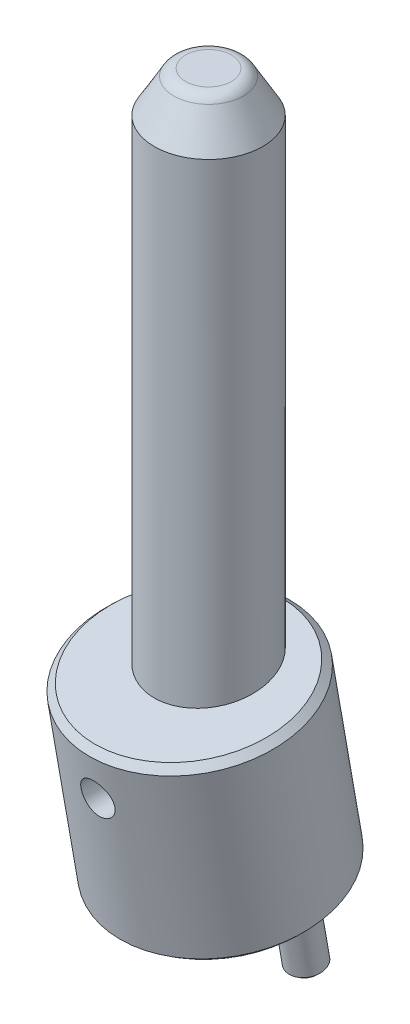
ISO-10303-21;
HEADER;
FILE_DESCRIPTION(('STEP AP214'),'2;1');
FILE_NAME('part.step','',(''),(''),'','','');
FILE_SCHEMA(('AUTOMOTIVE_DESIGN { 1 0 10303 214 1 1 1 1 }'));
ENDSEC;
DATA;
#1=APPLICATION_CONTEXT('core data for automotive mechanical design processes');
#2=APPLICATION_PROTOCOL_DEFINITION('international standard','automotive_design',2000,#1);
#3=PRODUCT_CONTEXT('',#1,'mechanical');
#4=PRODUCT('Part','Part','',(#3));
#5=PRODUCT_RELATED_PRODUCT_CATEGORY('part','',(#4));
#6=PRODUCT_DEFINITION_FORMATION('','',#4);
#7=PRODUCT_DEFINITION_CONTEXT('part definition',#1,'design');
#8=PRODUCT_DEFINITION('design','',#6,#7);
#9=PRODUCT_DEFINITION_SHAPE('','',#8);
#10=(LENGTH_UNIT() NAMED_UNIT(*) SI_UNIT(.MILLI.,.METRE.));
#11=(NAMED_UNIT(*) PLANE_ANGLE_UNIT() SI_UNIT($,.RADIAN.));
#12=(NAMED_UNIT(*) SI_UNIT($,.STERADIAN.) SOLID_ANGLE_UNIT());
#13=UNCERTAINTY_MEASURE_WITH_UNIT(LENGTH_MEASURE(1.E-05),#10,'distance_accuracy_value','');
#14=(GEOMETRIC_REPRESENTATION_CONTEXT(3) GLOBAL_UNCERTAINTY_ASSIGNED_CONTEXT((#13)) GLOBAL_UNIT_ASSIGNED_CONTEXT((#10,
#11,#12)) REPRESENTATION_CONTEXT('',''));
#15=CARTESIAN_POINT('',(0.,0.,0.));
#16=DIRECTION('',(0.,0.,1.));
#17=DIRECTION('',(1.,0.,0.));
#18=AXIS2_PLACEMENT_3D('',#15,#16,#17);
#19=CARTESIAN_POINT('',(0.,99.,0.));
#20=DIRECTION('',(0.,1.,0.));
#21=DIRECTION('',(-1.,0.,0.));
#22=AXIS2_PLACEMENT_3D('',#19,#20,#21);
#23=PLANE('',#22);
#24=CARTESIAN_POINT('',(0.,99.,-3.381197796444));
#25=CARTESIAN_POINT('',(0.0491775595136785,99.,-3.38119852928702));
#26=CARTESIAN_POINT('',(0.0983550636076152,99.,-3.38012493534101));
#27=CARTESIAN_POINT('',(0.196616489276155,99.,-3.37583435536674));
#28=CARTESIAN_POINT('',(0.245700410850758,99.,-3.37261736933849));
#29=CARTESIAN_POINT('',(0.343681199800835,99.,-3.36404526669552));
#30=CARTESIAN_POINT('',(0.392578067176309,99.,-3.35869015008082));
#31=CARTESIAN_POINT('',(0.490091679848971,99.,-3.3458522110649));
#32=CARTESIAN_POINT('',(0.53870842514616,99.,-3.33836938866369));
#33=CARTESIAN_POINT('',(0.635569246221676,99.,-3.321290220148));
#34=CARTESIAN_POINT('',(0.683813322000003,99.,-3.31169387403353));
#35=CARTESIAN_POINT('',(0.77983696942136,99.,-3.29040594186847));
#36=CARTESIAN_POINT('',(0.82761654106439,99.,-3.27871435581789));
#37=CARTESIAN_POINT('',(0.922620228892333,99.,-3.25325819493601));
#38=CARTESIAN_POINT('',(0.969844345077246,99.,-3.23949362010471));
#39=CARTESIAN_POINT('',(1.06364722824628,99.,-3.20991768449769));
#40=CARTESIAN_POINT('',(1.11022599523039,99.,-3.19410632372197));
#41=CARTESIAN_POINT('',(1.202649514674,99.,-3.16046691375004));
#42=CARTESIAN_POINT('',(1.24849426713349,99.,-3.14263886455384));
#43=CARTESIAN_POINT('',(1.33936248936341,99.,-3.10500001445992));
#44=CARTESIAN_POINT('',(1.38438595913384,99.,-3.08518921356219));
#45=CARTESIAN_POINT('',(1.47352591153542,99.,-3.04362257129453));
#46=CARTESIAN_POINT('',(1.51764239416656,99.,-3.02186672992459));
#47=CARTESIAN_POINT('',(1.60488439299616,99.,-2.97645141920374));
#48=CARTESIAN_POINT('',(1.64800990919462,99.,-2.95279194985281));
#49=CARTESIAN_POINT('',(1.73318788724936,99.,-2.90361442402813));
#50=CARTESIAN_POINT('',(1.77524034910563,99.,-2.87809636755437));
#51=CARTESIAN_POINT('',(1.85819215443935,99.,-2.82525022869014));
#52=CARTESIAN_POINT('',(1.89909149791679,98.9999999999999,-2.79792214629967));
#53=CARTESIAN_POINT('',(1.9796592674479,99.0000000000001,-2.74150802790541));
#54=CARTESIAN_POINT('',(2.01932769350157,99.0000000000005,-2.71242199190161));
#55=CARTESIAN_POINT('',(2.09735791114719,98.9999999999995,-2.65254714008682));
#56=CARTESIAN_POINT('',(2.13571970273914,98.9999999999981,-2.62175832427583));
#57=CARTESIAN_POINT('',(2.21106439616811,99.0000000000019,-2.55853724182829));
#58=CARTESIAN_POINT('',(2.24804729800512,99.000000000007,-2.52610497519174));
#59=CARTESIAN_POINT('',(2.32056094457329,98.9999999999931,-2.45965603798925));
#60=CARTESIAN_POINT('',(2.35609168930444,98.999999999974,-2.42563936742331));
#61=CARTESIAN_POINT('',(2.4270521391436,99.000000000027,-2.35468855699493));
#62=CARTESIAN_POINT('',(2.46241950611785,99.0000000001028,-2.3176920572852));
#63=CARTESIAN_POINT('',(2.53146011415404,98.9999999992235,-2.2421494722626));
#64=CARTESIAN_POINT('',(2.56513332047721,98.9999999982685,-2.20360335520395));
#65=CARTESIAN_POINT('',(2.63071590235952,98.9999999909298,-2.12503640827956));
#66=CARTESIAN_POINT('',(2.66262520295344,98.9999999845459,-2.08501551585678));
#67=CARTESIAN_POINT('',(2.72461562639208,98.9999999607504,-2.00357584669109));
#68=CARTESIAN_POINT('',(2.75469663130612,98.9999999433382,-1.962156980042));
#69=CARTESIAN_POINT('',(2.79840512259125,98.9999998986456,-1.89905244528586));
#70=CARTESIAN_POINT('',(2.81273996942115,98.9999998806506,-1.87785353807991));
#71=CARTESIAN_POINT('',(2.84090935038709,98.9999998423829,-1.83514783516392));
#72=CARTESIAN_POINT('',(2.85474423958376,98.9999998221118,-1.81364127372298));
#73=CARTESIAN_POINT('',(2.89548728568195,98.9999997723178,-1.74864245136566));
#74=CARTESIAN_POINT('',(2.92163476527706,98.9999997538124,-1.70466969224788));
#75=CARTESIAN_POINT('',(2.97183520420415,98.9999997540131,-1.61554840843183));
#76=CARTESIAN_POINT('',(2.99588817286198,98.9999997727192,-1.57039988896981));
#77=CARTESIAN_POINT('',(3.04188860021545,98.9999998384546,-1.47904330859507));
#78=CARTESIAN_POINT('',(3.06383620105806,98.999999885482,-1.43283531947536));
#79=CARTESIAN_POINT('',(3.10541271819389,98.9999999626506,-1.33939702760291));
#80=CARTESIAN_POINT('',(3.12504193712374,98.999999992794,-1.29216685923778));
#81=CARTESIAN_POINT('',(3.15291976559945,99.0000000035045,-1.22146858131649));
#82=CARTESIAN_POINT('',(3.1618349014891,99.000000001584,-1.1982567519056));
#83=CARTESIAN_POINT('',(3.19901993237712,98.9999999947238,-1.09818755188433));
#84=CARTESIAN_POINT('',(3.22479363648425,98.9999999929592,-1.02037068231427));
#85=CARTESIAN_POINT('',(3.25883872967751,98.999999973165,-0.903503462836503));
#86=CARTESIAN_POINT('',(3.26930037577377,98.999999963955,-0.865070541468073));
#87=CARTESIAN_POINT('',(3.29035807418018,98.9999999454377,-0.78187483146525));
#88=CARTESIAN_POINT('',(3.30072437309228,98.9999999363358,-0.737052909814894));
#89=CARTESIAN_POINT('',(3.31424558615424,98.9999999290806,-0.672514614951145));
#90=CARTESIAN_POINT('',(3.31816009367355,98.999999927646,-0.652953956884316));
#91=CARTESIAN_POINT('',(3.32632060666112,98.9999999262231,-0.610180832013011));
#92=CARTESIAN_POINT('',(3.33049626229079,98.9999999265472,-0.586954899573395));
#93=CARTESIAN_POINT('',(3.34228609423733,98.9999999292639,-0.517153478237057));
#94=CARTESIAN_POINT('',(3.34916375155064,98.9999999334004,-0.470451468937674));
#95=CARTESIAN_POINT('',(3.36093725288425,98.9999999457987,-0.37680095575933));
#96=CARTESIAN_POINT('',(3.36583314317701,98.9999999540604,-0.329852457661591));
#97=CARTESIAN_POINT('',(3.37363895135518,98.999999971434,-0.235792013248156));
#98=CARTESIAN_POINT('',(3.37654894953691,98.9999999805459,-0.188680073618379));
#99=CARTESIAN_POINT('',(3.38036477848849,98.9999999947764,-0.0943781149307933));
#100=CARTESIAN_POINT('',(3.381270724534,98.9999999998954,-0.0471881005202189));
#101=CARTESIAN_POINT('',(3.38112481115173,99.0000000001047,0.0472251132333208));
#102=CARTESIAN_POINT('',(3.38007141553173,98.9999999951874,0.09444830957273));
#103=CARTESIAN_POINT('',(3.37605062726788,98.9999999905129,0.188811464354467));
#104=CARTESIAN_POINT('',(3.37308329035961,98.9999999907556,0.2359514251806));
#105=CARTESIAN_POINT('',(3.36523468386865,98.9999999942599,0.330073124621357));
#106=CARTESIAN_POINT('',(3.36035337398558,98.9999999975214,0.377054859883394));
#107=CARTESIAN_POINT('',(3.34865879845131,99.0000000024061,0.47078071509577));
#108=CARTESIAN_POINT('',(3.34184539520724,99.000000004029,0.517524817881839));
#109=CARTESIAN_POINT('',(3.33026552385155,98.9999999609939,0.587415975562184));
#110=CARTESIAN_POINT('',(3.3261786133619,98.9999999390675,0.610677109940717));
#111=CARTESIAN_POINT('',(3.32001382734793,98.9999999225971,0.643328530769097));
#112=CARTESIAN_POINT('',(3.31818160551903,98.9999999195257,0.652765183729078));
#113=CARTESIAN_POINT('',(3.30790809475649,98.999999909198,0.704387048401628));
#114=CARTESIAN_POINT('',(3.29862776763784,98.999999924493,0.746407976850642));
#115=CARTESIAN_POINT('',(3.27611885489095,98.9999999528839,0.839847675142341));
#116=CARTESIAN_POINT('',(3.26247449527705,98.9999999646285,0.891165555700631));
#117=CARTESIAN_POINT('',(3.22698341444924,98.9999999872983,1.01297067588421));
#118=CARTESIAN_POINT('',(3.20401224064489,98.9999999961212,1.0831356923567));
#119=CARTESIAN_POINT('',(3.16757440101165,99.0000000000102,1.18334600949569));
#120=CARTESIAN_POINT('',(3.15590283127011,98.9999999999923,1.21405838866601));
#121=CARTESIAN_POINT('',(3.12494638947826,99.000000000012,1.2921679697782));
#122=CARTESIAN_POINT('',(3.10504413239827,99.0000000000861,1.33932320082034));
#123=CARTESIAN_POINT('',(3.06313614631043,98.9999999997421,1.43268851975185));
#124=CARTESIAN_POINT('',(3.04113038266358,98.9999999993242,1.47889859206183));
#125=CARTESIAN_POINT('',(2.9950713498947,98.9999999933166,1.57028914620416));
#126=CARTESIAN_POINT('',(2.97101799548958,98.9999999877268,1.61546958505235));
#127=CARTESIAN_POINT('',(2.92090425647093,98.9999999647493,1.7047092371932));
#128=CARTESIAN_POINT('',(2.89484373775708,98.9999999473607,1.74876837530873));
#129=CARTESIAN_POINT('',(2.85429856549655,98.9999999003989,1.81395013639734));
#130=CARTESIAN_POINT('',(2.84054017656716,98.9999998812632,1.83552759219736));
#131=CARTESIAN_POINT('',(2.81254197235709,98.9999998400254,1.87834577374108));
#132=CARTESIAN_POINT('',(2.7983025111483,98.9999998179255,1.89958673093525));
#133=CARTESIAN_POINT('',(2.75484041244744,98.9999997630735,1.96280026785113));
#134=CARTESIAN_POINT('',(2.72487327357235,98.9999997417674,2.00426478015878));
#135=CARTESIAN_POINT('',(2.6630249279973,98.999999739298,2.08573639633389));
#136=CARTESIAN_POINT('',(2.63114372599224,98.9999997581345,2.12574350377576));
#137=CARTESIAN_POINT('',(2.56557045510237,98.999999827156,2.20424440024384));
#138=CARTESIAN_POINT('',(2.53187851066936,98.9999998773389,2.24273829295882));
#139=CARTESIAN_POINT('',(2.46263073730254,98.9999999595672,2.31799882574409));
#140=CARTESIAN_POINT('',(2.42707516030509,98.9999999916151,2.35476569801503));
#141=CARTESIAN_POINT('',(2.37140677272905,99.0000000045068,2.41027252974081));
#142=CARTESIAN_POINT('',(2.35175738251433,99.0000000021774,2.42948514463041));
#143=CARTESIAN_POINT('',(2.26802085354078,98.9999999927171,2.50941121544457));
#144=CARTESIAN_POINT('',(2.20177871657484,98.9999999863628,2.56792039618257));
#145=CARTESIAN_POINT('',(2.10003782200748,98.9999999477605,2.65091291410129));
#146=CARTESIAN_POINT('',(2.06619123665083,98.9999999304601,2.67746023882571));
#147=CARTESIAN_POINT('',(1.99205588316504,98.9999998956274,2.7333276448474));
#148=CARTESIAN_POINT('',(1.95159525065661,98.9999998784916,2.76242170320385));
#149=CARTESIAN_POINT('',(1.89261855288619,98.9999998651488,2.80284359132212));
#150=CARTESIAN_POINT('',(1.87461413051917,98.9999998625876,2.81492542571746));
#151=CARTESIAN_POINT('',(1.83512217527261,98.9999998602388,2.84086885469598));
#152=CARTESIAN_POINT('',(1.81358901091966,98.9999998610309,2.85466108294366));
#153=CARTESIAN_POINT('',(1.74852510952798,98.9999998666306,2.89529180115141));
#154=CARTESIAN_POINT('',(1.70452676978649,98.999999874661,2.92138652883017));
#155=CARTESIAN_POINT('',(1.61538183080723,98.9999998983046,2.97152713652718));
#156=CARTESIAN_POINT('',(1.57023526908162,98.9999999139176,2.99557308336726));
#157=CARTESIAN_POINT('',(1.47889045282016,98.9999999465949,3.04157160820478));
#158=CARTESIAN_POINT('',(1.43269225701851,98.9999999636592,3.0635243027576));
#159=CARTESIAN_POINT('',(1.33933611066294,98.9999999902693,3.10527343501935));
#160=CARTESIAN_POINT('',(1.29217823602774,98.9999999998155,3.12507004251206));
#161=CARTESIAN_POINT('',(1.20065831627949,99.0000000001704,3.16109559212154));
#162=CARTESIAN_POINT('',(1.15635789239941,98.9999999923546,3.17748154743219));
#163=CARTESIAN_POINT('',(1.06713504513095,98.9999999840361,3.20845589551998));
#164=CARTESIAN_POINT('',(1.02221264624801,98.999999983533,3.22304435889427));
#165=CARTESIAN_POINT('',(0.931813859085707,98.9999999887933,3.25039463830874));
#166=CARTESIAN_POINT('',(0.886337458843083,98.9999999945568,3.26315641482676));
#167=CARTESIAN_POINT('',(0.794895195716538,99.0000000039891,3.28680491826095));
#168=CARTESIAN_POINT('',(0.74892929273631,99.0000000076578,3.29769149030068));
#169=CARTESIAN_POINT('',(0.686121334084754,98.9999999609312,3.31129818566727));
#170=CARTESIAN_POINT('',(0.669443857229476,98.9999999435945,3.31479031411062));
#171=CARTESIAN_POINT('',(0.639370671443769,98.9999999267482,3.32077892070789));
#172=CARTESIAN_POINT('',(0.625986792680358,98.9999999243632,3.32333471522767));
#173=CARTESIAN_POINT('',(0.564781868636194,98.9999999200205,3.33461824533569));
#174=CARTESIAN_POINT('',(0.516772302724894,98.9999999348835,3.34234416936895));
#175=CARTESIAN_POINT('',(0.428809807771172,98.9999999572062,3.35455837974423));
#176=CARTESIAN_POINT('',(0.388901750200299,98.9999999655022,3.35937566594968));
#177=CARTESIAN_POINT('',(0.315880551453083,98.9999999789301,3.36686744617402));
#178=CARTESIAN_POINT('',(0.28279046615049,98.9999999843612,3.36976874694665));
#179=CARTESIAN_POINT('',(0.198641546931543,98.9999999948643,3.37590123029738));
#180=CARTESIAN_POINT('',(0.147531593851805,98.9999999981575,3.37846406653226));
#181=CARTESIAN_POINT('',(0.0775593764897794,98.9999999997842,3.38039422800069));
#182=CARTESIAN_POINT('',(0.0587195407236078,98.9999999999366,3.38075747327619));
#183=CARTESIAN_POINT('',(0.0265859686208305,99.0000000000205,3.38112029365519));
#184=CARTESIAN_POINT('',(0.0132930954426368,99.0000000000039,3.38119547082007));
#185=CARTESIAN_POINT('',(0.,99.,3.381197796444));
#186=B_SPLINE_CURVE_WITH_KNOTS('',3,(#24,#25,#26,#27,#28,#29,#30,#31,#32,#33,#34,#35,#36,#37,
#38,#39,#40,#41,#42,#43,#44,#45,#46,#47,#48,#49,#50,#51,#52,#53,#54,#55,#56,#57,#58,#59,#60,#61,
#62,#63,#64,#65,#66,#67,#68,#69,#70,#71,#72,#73,#74,#75,#76,#77,#78,#79,#80,#81,#82,#83,#84,#85,
#86,#87,#88,#89,#90,#91,#92,#93,#94,#95,#96,#97,#98,#99,#100,#101,#102,#103,#104,#105,#106,#107,
#108,#109,#110,#111,#112,#113,#114,#115,#116,#117,#118,#119,#120,#121,#122,#123,#124,#125,#126,
#127,#128,#129,#130,#131,#132,#133,#134,#135,#136,#137,#138,#139,#140,#141,#142,#143,#144,#145,
#146,#147,#148,#149,#150,#151,#152,#153,#154,#155,#156,#157,#158,#159,#160,#161,#162,#163,#164,
#165,#166,#167,#168,#169,#170,#171,#172,#173,#174,#175,#176,#177,#178,#179,#180,#181,#182,#183,
#184,#185),.UNSPECIFIED.,.F.,.F.,(4,2,2,2,2,2,2,2,2,2,2,2,2,2,2,2,2,2,2,2,2,2,2,2,2,2,2,2,2,2,2,
2,2,2,2,2,2,2,2,2,2,2,2,2,2,2,2,2,2,2,2,2,2,2,2,2,2,2,2,2,2,2,2,2,2,2,2,2,2,2,2,2,2,2,2,2,2,2,2,
2,4),(0.,0.147520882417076,0.295041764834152,0.442562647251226,0.590083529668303,
0.737604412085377,0.885125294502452,1.03264617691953,1.18016705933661,1.32768794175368,
1.47520882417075,1.62272970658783,1.77025058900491,1.91777147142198,2.06529235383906,
2.21281323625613,2.36033411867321,2.50785500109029,2.65537588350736,2.80886971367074,
2.96236668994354,3.11587018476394,3.26938357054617,3.34614986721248,3.42286052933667,
3.57627689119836,3.72969256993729,3.88309788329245,4.03648314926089,4.11107818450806,
4.35672731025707,4.47620511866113,4.61417295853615,4.67401611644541,4.7448062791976,
4.88637772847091,5.02794587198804,5.16950829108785,5.31106256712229,5.45272787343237,
5.59438905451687,5.73605321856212,5.87772747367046,5.94857428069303,5.9774125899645,
6.106474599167,6.26572562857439,6.48702972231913,6.58558754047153,6.73908101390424,
6.89257701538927,7.04607941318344,7.19959207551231,7.27635829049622,7.3530691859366,
7.50648650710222,7.65990345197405,7.81330986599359,7.96669559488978,8.04913919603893,
8.3139440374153,8.4429705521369,8.59241517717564,8.65745956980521,8.73416806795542,
8.88757343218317,9.04097379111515,9.19436560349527,9.34774532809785,9.48940809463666,
9.6310652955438,9.77272556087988,9.91439752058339,9.9655130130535,10.006389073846,
10.152216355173,10.2727850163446,10.3724238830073,10.5258841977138,10.5824125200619,
10.6222911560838),.UNSPECIFIED.);
#187=CARTESIAN_POINT('',(0.,99.,-3.3811978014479));
#188=VERTEX_POINT('',#187);
#189=CARTESIAN_POINT('',(0.,99.,3.3811978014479));
#190=VERTEX_POINT('',#189);
#191=EDGE_CURVE('P0_E38',#188,#190,#186,.T.);
#192=ORIENTED_EDGE('',*,*,#191,.F.);
#193=CARTESIAN_POINT('',(0.,99.,0.));
#194=DIRECTION('',(0.,-1.,0.));
#195=DIRECTION('',(0.,0.,1.));
#196=AXIS2_PLACEMENT_3D('',#193,#194,#195);
#197=CIRCLE('',#196,3.381197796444);
#198=EDGE_CURVE('P0_E42',#190,#188,#197,.T.);
#199=ORIENTED_EDGE('',*,*,#198,.F.);
#200=EDGE_LOOP('',(#192,#199));
#201=FACE_BOUND('',#200,.T.);
#202=ADVANCED_FACE('P0_F17',(#201),#23,.T.);
#203=CARTESIAN_POINT('',(0.,97.,0.));
#204=DIRECTION('',(0.,1.,0.));
#205=DIRECTION('',(0.0117940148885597,0.,0.999930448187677));
#206=AXIS2_PLACEMENT_3D('',#203,#204,#205);
#207=TOROIDAL_SURFACE('',#206,3.381197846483,2.);
#208=ORIENTED_EDGE('',*,*,#191,.T.);
#209=ORIENTED_EDGE('',*,*,#198,.T.);
#210=EDGE_LOOP('',(#208,#209));
#211=FACE_BOUND('',#210,.T.);
#212=CARTESIAN_POINT('',(0.,98.0000000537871,0.));
#213=DIRECTION('',(0.,-1.,0.));
#214=DIRECTION('',(0.,0.,1.));
#215=AXIS2_PLACEMENT_3D('',#212,#213,#214);
#216=CIRCLE('',#215,5.11324862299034);
#217=CARTESIAN_POINT('',(0.,98.0000000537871,5.11324862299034));
#218=VERTEX_POINT('',#217);
#219=EDGE_CURVE('P0_E48',#218,#218,#216,.T.);
#220=ORIENTED_EDGE('',*,*,#219,.F.);
#221=EDGE_LOOP('',(#220));
#222=FACE_BOUND('',#221,.T.);
#223=ADVANCED_FACE('P0_F40',(#211,#222),#207,.T.);
#224=CARTESIAN_POINT('',(0.,0.,0.));
#225=DIRECTION('',(0.,1.,0.));
#226=DIRECTION('',(-1.,0.,0.));
#227=AXIS2_PLACEMENT_3D('',#224,#225,#226);
#228=PLANE('',#227);
#229=CARTESIAN_POINT('',(0.,6.2631058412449E-07,0.));
#230=DIRECTION('',(0.,1.,0.));
#231=DIRECTION('',(-1.,0.,0.));
#232=AXIS2_PLACEMENT_3D('',#229,#230,#231);
#233=CIRCLE('',#232,6.99999848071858);
#234=CARTESIAN_POINT('',(-6.99999848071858,6.26310584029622E-07,0.));
#235=VERTEX_POINT('',#234);
#236=EDGE_CURVE('P0_E85',#235,#235,#233,.T.);
#237=ORIENTED_EDGE('',*,*,#236,.F.);
#238=EDGE_LOOP('',(#237));
#239=FACE_BOUND('',#238,.T.);
#240=ADVANCED_FACE('P0_F76',(#239),#228,.F.);
#241=CARTESIAN_POINT('',(0.,14.,2.94337567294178));
#242=DIRECTION('',(0.,0.,1.));
#243=DIRECTION('',(0.,-1.,0.));
#244=AXIS2_PLACEMENT_3D('',#241,#242,#243);
#245=CONICAL_SURFACE('',#244,2.50000000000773,1.04719755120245);
#246=CARTESIAN_POINT('',(0.,14.0000000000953,1.49999999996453));
#247=VERTEX_POINT('',#246);
#248=VERTEX_LOOP('',#247);
#249=FACE_BOUND('',#248,.T.);
#250=CARTESIAN_POINT('',(0.,14.,2.943375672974));
#251=DIRECTION('',(0.,0.,1.));
#252=DIRECTION('',(0.,-1.,0.));
#253=AXIS2_PLACEMENT_3D('',#250,#251,#252);
#254=CIRCLE('',#253,2.5);
#255=CARTESIAN_POINT('',(0.,11.5,2.943375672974));
#256=VERTEX_POINT('',#255);
#257=EDGE_CURVE('P0_E82',#256,#256,#254,.T.);
#258=ORIENTED_EDGE('',*,*,#257,.T.);
#259=EDGE_LOOP('',(#258));
#260=FACE_BOUND('',#259,.T.);
#261=ADVANCED_FACE('P0_F116',(#249,#260),#245,.F.);
#262=CARTESIAN_POINT('',(0.,93.0000000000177,0.));
#263=DIRECTION('',(0.,-1.,0.));
#264=DIRECTION('',(1.,0.,0.));
#265=AXIS2_PLACEMENT_3D('',#262,#263,#264);
#266=CONICAL_SURFACE('',#265,7.99999999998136,0.523598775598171);
#267=CARTESIAN_POINT('',(0.,93.,0.));
#268=DIRECTION('',(0.,1.,0.));
#269=DIRECTION('',(-1.,0.,0.));
#270=AXIS2_PLACEMENT_3D('',#267,#268,#269);
#271=CIRCLE('',#270,8.);
#272=CARTESIAN_POINT('',(-8.,93.,0.));
#273=VERTEX_POINT('',#272);
#274=EDGE_CURVE('P0_E92',#273,#273,#271,.F.);
#275=ORIENTED_EDGE('',*,*,#274,.F.);
#276=EDGE_LOOP('',(#275));
#277=FACE_BOUND('',#276,.T.);
#278=ORIENTED_EDGE('',*,*,#219,.T.);
#279=EDGE_LOOP('',(#278));
#280=FACE_BOUND('',#279,.T.);
#281=ADVANCED_FACE('P0_F108',(#277,#280),#266,.T.);
#282=CARTESIAN_POINT('',(0.,1.00000173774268,0.));
#283=DIRECTION('',(0.,1.,0.));
#284=DIRECTION('',(-1.,0.,0.));
#285=AXIS2_PLACEMENT_3D('',#282,#283,#284);
#286=CONICAL_SURFACE('',#285,7.9999992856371,0.785398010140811);
#287=CARTESIAN_POINT('',(0.,1.00000102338,0.));
#288=DIRECTION('',(0.,1.,0.));
#289=DIRECTION('',(-1.,0.,0.));
#290=AXIS2_PLACEMENT_3D('',#287,#288,#289);
#291=CIRCLE('',#290,8.);
#292=CARTESIAN_POINT('',(-8.,1.00000102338,0.));
#293=VERTEX_POINT('',#292);
#294=EDGE_CURVE('P0_E28',#293,#293,#291,.T.);
#295=ORIENTED_EDGE('',*,*,#294,.F.);
#296=EDGE_LOOP('',(#295));
#297=FACE_BOUND('',#296,.T.);
#298=ORIENTED_EDGE('',*,*,#236,.T.);
#299=EDGE_LOOP('',(#298));
#300=FACE_BOUND('',#299,.T.);
#301=ADVANCED_FACE('P0_F105',(#297,#300),#286,.T.);
#302=CARTESIAN_POINT('',(0.,14.,1.075));
#303=DIRECTION('',(0.,0.,1.));
#304=DIRECTION('',(0.,-1.,0.));
#305=AXIS2_PLACEMENT_3D('',#302,#303,#304);
#306=CYLINDRICAL_SURFACE('',#305,2.5);
#307=ORIENTED_EDGE('',*,*,#257,.F.);
#308=EDGE_LOOP('',(#307));
#309=FACE_BOUND('',#308,.T.);
#310=CARTESIAN_POINT('',(0.,11.5,8.));
#311=CARTESIAN_POINT('',(-0.136696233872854,11.5000075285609,7.99999486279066));
#312=CARTESIAN_POINT('',(-0.273538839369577,11.5112631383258,7.99645812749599));
#313=CARTESIAN_POINT('',(-0.543359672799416,11.5559205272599,7.98267442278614));
#314=CARTESIAN_POINT('',(-0.676330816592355,11.589360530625,7.97241587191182));
#315=CARTESIAN_POINT('',(-0.934271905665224,11.6771461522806,7.94631394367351));
#316=CARTESIAN_POINT('',(-1.05925832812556,11.7314469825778,7.93048253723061));
#317=CARTESIAN_POINT('',(-1.2983071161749,11.8592577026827,7.89487323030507));
#318=CARTESIAN_POINT('',(-1.4123711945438,11.9327645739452,7.87509595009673));
#319=CARTESIAN_POINT('',(-1.62992724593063,12.0993097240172,7.83300483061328));
#320=CARTESIAN_POINT('',(-1.73303436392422,12.1928367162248,7.81063552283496));
#321=CARTESIAN_POINT('',(-1.92239021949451,12.3957308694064,7.76620212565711));
#322=CARTESIAN_POINT('',(-2.00863490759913,12.5051018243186,7.74413811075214));
#323=CARTESIAN_POINT('',(-2.16388692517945,12.7398894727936,7.70222283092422));
#324=CARTESIAN_POINT('',(-2.23241606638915,12.8656356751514,7.6824396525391));
#325=CARTESIAN_POINT('',(-2.34719509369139,13.1275854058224,7.64815595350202));
#326=CARTESIAN_POINT('',(-2.3934509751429,13.2637861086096,7.6336540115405));
#327=CARTESIAN_POINT('',(-2.4609691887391,13.5384561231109,7.61215214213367));
#328=CARTESIAN_POINT('',(-2.48294218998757,13.6767336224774,7.60493946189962));
#329=CARTESIAN_POINT('',(-2.50349110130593,13.9551861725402,7.59820110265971));
#330=CARTESIAN_POINT('',(-2.50207322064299,14.0953607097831,7.59867338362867));
#331=CARTESIAN_POINT('',(-2.47643652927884,14.3677485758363,7.60706377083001));
#332=CARTESIAN_POINT('',(-2.45312128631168,14.5000575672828,7.61468679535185));
#333=CARTESIAN_POINT('',(-2.38581648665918,14.7587836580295,7.63604044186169));
#334=CARTESIAN_POINT('',(-2.34182462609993,14.8852000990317,7.64977174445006));
#335=CARTESIAN_POINT('',(-2.23377596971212,15.1307074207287,7.68202134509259));
#336=CARTESIAN_POINT('',(-2.16943495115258,15.2496640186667,7.7006067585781));
#337=CARTESIAN_POINT('',(-2.02271557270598,15.4753816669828,7.74043834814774));
#338=CARTESIAN_POINT('',(-1.94033355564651,15.5821402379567,7.76168506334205));
#339=CARTESIAN_POINT('',(-1.75545127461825,15.7855312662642,7.80562654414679));
#340=CARTESIAN_POINT('',(-1.65220788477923,15.8814846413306,7.82834327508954));
#341=CARTESIAN_POINT('',(-1.43076939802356,16.0549161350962,7.87182395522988));
#342=CARTESIAN_POINT('',(-1.31256787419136,16.1323862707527,7.8925870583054));
#343=CARTESIAN_POINT('',(-1.06322528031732,16.2671146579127,7.93004255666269));
#344=CARTESIAN_POINT('',(-0.931982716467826,16.3241954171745,7.94669883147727));
#345=CARTESIAN_POINT('',(-0.661263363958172,16.4151681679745,7.97377752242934));
#346=CARTESIAN_POINT('',(-0.521804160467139,16.4491078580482,7.98421275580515));
#347=CARTESIAN_POINT('',(-0.317572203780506,16.4805676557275,7.9939447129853));
#348=CARTESIAN_POINT('',(-0.25430866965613,16.4878463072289,7.99620897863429));
#349=CARTESIAN_POINT('',(-0.127374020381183,16.4975642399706,7.99923782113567));
#350=CARTESIAN_POINT('',(-0.0637029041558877,16.5000035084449,8.000002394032));
#351=CARTESIAN_POINT('',(0.13669623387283,16.4999924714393,7.99999486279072));
#352=CARTESIAN_POINT('',(0.273538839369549,16.4887368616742,7.996458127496));
#353=CARTESIAN_POINT('',(0.543359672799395,16.4440794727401,7.98267442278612));
#354=CARTESIAN_POINT('',(0.676330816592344,16.410639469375,7.97241587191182));
#355=CARTESIAN_POINT('',(0.934271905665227,16.3228538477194,7.94631394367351));
#356=CARTESIAN_POINT('',(1.05925832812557,16.2685530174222,7.93048253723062));
#357=CARTESIAN_POINT('',(1.2983071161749,16.1407422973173,7.89487323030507));
#358=CARTESIAN_POINT('',(1.4123711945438,16.0672354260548,7.87509595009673));
#359=CARTESIAN_POINT('',(1.62992724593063,15.9006902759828,7.83300483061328));
#360=CARTESIAN_POINT('',(1.73303436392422,15.8071632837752,7.81063552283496));
#361=CARTESIAN_POINT('',(1.92239021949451,15.6042691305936,7.76620212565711));
#362=CARTESIAN_POINT('',(2.00863490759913,15.4948981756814,7.74413811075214));
#363=CARTESIAN_POINT('',(2.16388692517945,15.2601105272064,7.70222283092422));
#364=CARTESIAN_POINT('',(2.23241606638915,15.1343643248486,7.6824396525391));
#365=CARTESIAN_POINT('',(2.34719509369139,14.8724145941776,7.64815595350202));
#366=CARTESIAN_POINT('',(2.3934509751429,14.7362138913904,7.6336540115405));
#367=CARTESIAN_POINT('',(2.4609691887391,14.4615438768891,7.61215214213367));
#368=CARTESIAN_POINT('',(2.48294218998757,14.3232663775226,7.60493946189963));
#369=CARTESIAN_POINT('',(2.50349110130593,14.0448138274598,7.59820110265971));
#370=CARTESIAN_POINT('',(2.50207322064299,13.9046392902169,7.59867338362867));
#371=CARTESIAN_POINT('',(2.47643652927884,13.6322514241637,7.60706377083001));
#372=CARTESIAN_POINT('',(2.45312128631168,13.4999424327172,7.61468679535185));
#373=CARTESIAN_POINT('',(2.38581648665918,13.2412163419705,7.63604044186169));
#374=CARTESIAN_POINT('',(2.34182462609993,13.1147999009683,7.64977174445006));
#375=CARTESIAN_POINT('',(2.23377596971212,12.8692925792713,7.68202134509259));
#376=CARTESIAN_POINT('',(2.16943495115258,12.7503359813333,7.7006067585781));
#377=CARTESIAN_POINT('',(2.02271557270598,12.5246183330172,7.74043834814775));
#378=CARTESIAN_POINT('',(1.94033355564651,12.4178597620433,7.76168506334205));
#379=CARTESIAN_POINT('',(1.75545127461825,12.2144687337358,7.80562654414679));
#380=CARTESIAN_POINT('',(1.65220788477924,12.1185153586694,7.82834327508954));
#381=CARTESIAN_POINT('',(1.43076939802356,11.9450838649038,7.87182395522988));
#382=CARTESIAN_POINT('',(1.31256787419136,11.8676137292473,7.8925870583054));
#383=CARTESIAN_POINT('',(1.06322528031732,11.7328853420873,7.93004255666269));
#384=CARTESIAN_POINT('',(0.931982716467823,11.6758045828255,7.94669883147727));
#385=CARTESIAN_POINT('',(0.661263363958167,11.5848318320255,7.97377752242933));
#386=CARTESIAN_POINT('',(0.521804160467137,11.5508921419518,7.98421275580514));
#387=CARTESIAN_POINT('',(0.317572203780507,11.5194323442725,7.9939447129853));
#388=CARTESIAN_POINT('',(0.254308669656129,11.512153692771,7.9962089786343));
#389=CARTESIAN_POINT('',(0.127374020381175,11.5024357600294,7.99923782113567));
#390=CARTESIAN_POINT('',(0.0637029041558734,11.4999964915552,8.00000239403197));
#391=CARTESIAN_POINT('',(0.,11.5,8.));
#392=B_SPLINE_CURVE_WITH_KNOTS('',3,(#310,#311,#312,#313,#314,#315,#316,#317,#318,#319,#320,
#321,#322,#323,#324,#325,#326,#327,#328,#329,#330,#331,#332,#333,#334,#335,#336,#337,#338,#339,
#340,#341,#342,#343,#344,#345,#346,#347,#348,#349,#350,#351,#352,#353,#354,#355,#356,#357,#358,
#359,#360,#361,#362,#363,#364,#365,#366,#367,#368,#369,#370,#371,#372,#373,#374,#375,#376,#377,
#378,#379,#380,#381,#382,#383,#384,#385,#386,#387,#388,#389,#390,#391),.UNSPECIFIED.,.T.,.F.,(4,
2,2,2,2,2,2,2,2,2,2,2,2,2,2,2,2,2,2,2,2,2,2,2,2,2,2,2,2,2,2,2,2,2,2,2,2,2,2,2,4),(0.,
0.409843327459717,0.820394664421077,1.23006943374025,1.6396798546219,2.06074511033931,
2.48191136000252,2.91347666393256,3.34492573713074,3.76338291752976,4.18172901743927,
4.58353732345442,4.98539041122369,5.39312450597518,5.80094133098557,6.22725884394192,
6.65376015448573,7.08388858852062,7.51312773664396,7.70412159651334,7.89511596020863,
8.30495928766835,8.71551062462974,9.12518539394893,9.53479581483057,9.95586107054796,
10.3770273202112,10.8085926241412,11.2400416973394,11.6584988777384,12.0768449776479,
12.4786532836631,12.8805063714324,13.2882404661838,13.6960572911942,14.1223748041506,
14.5488761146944,14.9790045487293,15.4082436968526,15.599237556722,15.7902319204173),.UNSPECIFIED.);
#393=CARTESIAN_POINT('',(0.,11.5,8.));
#394=VERTEX_POINT('',#393);
#395=EDGE_CURVE('P0_E11',#394,#394,#392,.T.);
#396=ORIENTED_EDGE('',*,*,#395,.F.);
#397=EDGE_LOOP('',(#396));
#398=FACE_BOUND('',#397,.T.);
#399=ADVANCED_FACE('P0_F107',(#309,#398),#306,.F.);
#400=CARTESIAN_POINT('',(0.,-4.95,0.));
#401=DIRECTION('',(0.,1.,0.));
#402=DIRECTION('',(-1.,0.,0.));
#403=AXIS2_PLACEMENT_3D('',#400,#401,#402);
#404=CYLINDRICAL_SURFACE('',#403,8.);
#405=ORIENTED_EDGE('',*,*,#274,.T.);
#406=EDGE_LOOP('',(#405));
#407=FACE_BOUND('',#406,.T.);
#408=ORIENTED_EDGE('',*,*,#294,.T.);
#409=EDGE_LOOP('',(#408));
#410=FACE_BOUND('',#409,.T.);
#411=ORIENTED_EDGE('',*,*,#395,.T.);
#412=EDGE_LOOP('',(#411));
#413=FACE_BOUND('',#412,.T.);
#414=ADVANCED_FACE('P0_F102',(#407,#410,#413),#404,.T.);
#415=CLOSED_SHELL('',(#202,#223,#240,#261,#281,#301,#399,#414));
#416=MANIFOLD_SOLID_BREP('P0_B1',#415);
#417=CARTESIAN_POINT('',(0.,-11.4816197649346,-3.21008704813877));
#418=DIRECTION('',(0.,-0.984807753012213,-0.173648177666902));
#419=DIRECTION('',(0.,0.173648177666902,-0.984807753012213));
#420=AXIS2_PLACEMENT_3D('',#417,#418,#419);
#421=PLANE('',#420);
#422=CARTESIAN_POINT('',(-11.25,-11.4816197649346,-3.21008704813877));
#423=DIRECTION('',(0.,-0.984807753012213,-0.173648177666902));
#424=DIRECTION('',(0.,0.173648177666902,-0.984807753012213));
#425=AXIS2_PLACEMENT_3D('',#422,#423,#424);
#426=CIRCLE('',#425,1.9999654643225);
#427=CARTESIAN_POINT('',(-11.25,-11.1343294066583,-5.17966854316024));
#428=VERTEX_POINT('',#427);
#429=EDGE_CURVE('P1_E17',#428,#428,#426,.F.);
#430=ORIENTED_EDGE('',*,*,#429,.F.);
#431=EDGE_LOOP('',(#430));
#432=FACE_BOUND('',#431,.T.);
#433=ADVANCED_FACE('P1_F14',(#432),#421,.T.);
#434=CARTESIAN_POINT('',(0.,-11.4816197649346,-3.21008704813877));
#435=DIRECTION('',(0.,-0.984807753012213,-0.173648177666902));
#436=DIRECTION('',(0.,0.173648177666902,-0.984807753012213));
#437=AXIS2_PLACEMENT_3D('',#434,#435,#436);
#438=PLANE('',#437);
#439=CARTESIAN_POINT('',(11.25,-11.4816197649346,-3.21008704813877));
#440=DIRECTION('',(0.,-0.984807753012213,-0.173648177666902));
#441=DIRECTION('',(0.,0.173648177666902,-0.984807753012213));
#442=AXIS2_PLACEMENT_3D('',#439,#440,#441);
#443=CIRCLE('',#442,1.99996546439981);
#444=CARTESIAN_POINT('',(11.25,-11.1343294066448,-5.17966854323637));
#445=VERTEX_POINT('',#444);
#446=EDGE_CURVE('P1_E114',#445,#445,#443,.F.);
#447=ORIENTED_EDGE('',*,*,#446,.F.);
#448=EDGE_LOOP('',(#447));
#449=FACE_BOUND('',#448,.T.);
#450=ADVANCED_FACE('P1_F104',(#449),#438,.T.);
#451=CARTESIAN_POINT('',(0.,-2.78423117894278E-13,0.));
#452=DIRECTION('',(0.,-1.,0.));
#453=DIRECTION('',(0.,0.,-1.));
#454=AXIS2_PLACEMENT_3D('',#451,#452,#453);
#455=PLANE('',#454);
#456=CARTESIAN_POINT('',(0.,-1.8474805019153E-13,-1.19479079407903E-13));
#457=DIRECTION('',(0.,-1.,0.));
#458=DIRECTION('',(0.,0.,-1.));
#459=AXIS2_PLACEMENT_3D('',#456,#457,#458);
#460=CIRCLE('',#459,8.);
#461=CARTESIAN_POINT('',(0.,-1.8474805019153E-13,-8.00000000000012));
#462=VERTEX_POINT('',#461);
#463=EDGE_CURVE('P1_E116',#462,#462,#460,.F.);
#464=ORIENTED_EDGE('',*,*,#463,.T.);
#465=EDGE_LOOP('',(#464));
#466=FACE_BOUND('',#465,.T.);
#467=ADVANCED_FACE('P1_F101',(#466),#455,.F.);
#468=CARTESIAN_POINT('',(-11.25,-10.9891918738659,-3.12325872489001));
#469=DIRECTION('',(0.,0.984807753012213,0.173648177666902));
#470=DIRECTION('',(0.,-0.173648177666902,0.984807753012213));
#471=AXIS2_PLACEMENT_3D('',#468,#469,#470);
#472=CONICAL_SURFACE('',#471,2.49998121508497,0.78538952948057);
#473=CARTESIAN_POINT('',(-11.25,-10.9891733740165,-3.12325546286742));
#474=DIRECTION('',(0.,0.984807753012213,0.173648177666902));
#475=DIRECTION('',(0.,-0.173648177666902,0.984807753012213));
#476=AXIS2_PLACEMENT_3D('',#473,#474,#475);
#477=CIRCLE('',#476,2.5);
#478=CARTESIAN_POINT('',(-11.25,-11.4232938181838,-0.661236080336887));
#479=VERTEX_POINT('',#478);
#480=EDGE_CURVE('P1_E118',#479,#479,#477,.T.);
#481=ORIENTED_EDGE('',*,*,#480,.F.);
#482=EDGE_LOOP('',(#481));
#483=FACE_BOUND('',#482,.T.);
#484=ORIENTED_EDGE('',*,*,#429,.T.);
#485=EDGE_LOOP('',(#484));
#486=FACE_BOUND('',#485,.T.);
#487=ADVANCED_FACE('P1_F97',(#483,#486),#472,.T.);
#488=CARTESIAN_POINT('',(11.25,-10.9891918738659,-3.12325872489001));
#489=DIRECTION('',(0.,0.984807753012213,0.173648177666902));
#490=DIRECTION('',(0.,-0.173648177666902,0.984807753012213));
#491=AXIS2_PLACEMENT_3D('',#488,#489,#490);
#492=CONICAL_SURFACE('',#491,2.49998121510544,0.785389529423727);
#493=CARTESIAN_POINT('',(11.25,-10.9891733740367,-3.12325546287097));
#494=DIRECTION('',(0.,0.984807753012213,0.173648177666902));
#495=DIRECTION('',(0.,-0.173648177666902,0.984807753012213));
#496=AXIS2_PLACEMENT_3D('',#493,#494,#495);
#497=CIRCLE('',#496,2.5);
#498=CARTESIAN_POINT('',(11.25,-11.4232938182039,-0.66123608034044));
#499=VERTEX_POINT('',#498);
#500=EDGE_CURVE('P1_E123',#499,#499,#497,.T.);
#501=ORIENTED_EDGE('',*,*,#500,.F.);
#502=EDGE_LOOP('',(#501));
#503=FACE_BOUND('',#502,.T.);
#504=ORIENTED_EDGE('',*,*,#446,.T.);
#505=EDGE_LOOP('',(#504));
#506=FACE_BOUND('',#505,.T.);
#507=ADVANCED_FACE('P1_F92',(#503,#506),#492,.T.);
#508=CARTESIAN_POINT('',(0.,28.8048886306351,-1.196959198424E-13));
#509=DIRECTION('',(0.,-1.,0.));
#510=DIRECTION('',(0.,0.,-1.));
#511=AXIS2_PLACEMENT_3D('',#508,#509,#510);
#512=CYLINDRICAL_SURFACE('',#511,8.);
#513=CARTESIAN_POINT('',(0.,23.9999999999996,-1.196959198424E-13));
#514=DIRECTION('',(0.,0.984807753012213,0.173648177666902));
#515=DIRECTION('',(0.,-0.173648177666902,0.984807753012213));
#516=AXIS2_PLACEMENT_3D('',#513,#514,#515);
#517=ELLIPSE('',#516,8.12341289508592,8.);
#518=CARTESIAN_POINT('',(0.,22.5893841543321,7.99999999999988));
#519=VERTEX_POINT('',#518);
#520=EDGE_CURVE('P1_E79',#519,#519,#517,.F.);
#521=ORIENTED_EDGE('',*,*,#520,.F.);
#522=EDGE_LOOP('',(#521));
#523=FACE_BOUND('',#522,.T.);
#524=ORIENTED_EDGE('',*,*,#463,.F.);
#525=EDGE_LOOP('',(#524));
#526=FACE_BOUND('',#525,.T.);
#527=CARTESIAN_POINT('',(0.,16.4999999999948,7.99999999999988));
#528=CARTESIAN_POINT('',(-0.136696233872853,16.499992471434,7.99999486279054));
#529=CARTESIAN_POINT('',(-0.273538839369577,16.488736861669,7.99645812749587));
#530=CARTESIAN_POINT('',(-0.543359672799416,16.444079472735,7.98267442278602));
#531=CARTESIAN_POINT('',(-0.676330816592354,16.4106394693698,7.9724158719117));
#532=CARTESIAN_POINT('',(-0.934271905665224,16.3228538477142,7.94631394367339));
#533=CARTESIAN_POINT('',(-1.05925832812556,16.2685530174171,7.93048253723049));
#534=CARTESIAN_POINT('',(-1.2983071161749,16.1407422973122,7.89487323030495));
#535=CARTESIAN_POINT('',(-1.4123711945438,16.0672354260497,7.87509595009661));
#536=CARTESIAN_POINT('',(-1.62992724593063,15.9006902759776,7.83300483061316));
#537=CARTESIAN_POINT('',(-1.73303436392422,15.8071632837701,7.81063552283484));
#538=CARTESIAN_POINT('',(-1.92239021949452,15.6042691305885,7.76620212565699));
#539=CARTESIAN_POINT('',(-2.00863490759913,15.4948981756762,7.74413811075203));
#540=CARTESIAN_POINT('',(-2.16388692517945,15.2601105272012,7.7022228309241));
#541=CARTESIAN_POINT('',(-2.23241606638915,15.1343643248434,7.68243965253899));
#542=CARTESIAN_POINT('',(-2.34719509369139,14.8724145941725,7.6481559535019));
#543=CARTESIAN_POINT('',(-2.3934509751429,14.7362138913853,7.63365401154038));
#544=CARTESIAN_POINT('',(-2.4609691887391,14.4615438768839,7.61215214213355));
#545=CARTESIAN_POINT('',(-2.48294218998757,14.3232663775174,7.60493946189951));
#546=CARTESIAN_POINT('',(-2.50349110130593,14.0448138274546,7.59820110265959));
#547=CARTESIAN_POINT('',(-2.50207322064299,13.9046392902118,7.59867338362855));
#548=CARTESIAN_POINT('',(-2.47643652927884,13.6322514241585,7.60706377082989));
#549=CARTESIAN_POINT('',(-2.45312128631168,13.4999424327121,7.61468679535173));
#550=CARTESIAN_POINT('',(-2.38581648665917,13.2412163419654,7.63604044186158));
#551=CARTESIAN_POINT('',(-2.34182462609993,13.1147999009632,7.64977174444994));
#552=CARTESIAN_POINT('',(-2.23377596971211,12.8692925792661,7.68202134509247));
#553=CARTESIAN_POINT('',(-2.16943495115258,12.7503359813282,7.70060675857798));
#554=CARTESIAN_POINT('',(-2.02271557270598,12.5246183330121,7.74043834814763));
#555=CARTESIAN_POINT('',(-1.94033355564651,12.4178597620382,7.76168506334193));
#556=CARTESIAN_POINT('',(-1.75545127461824,12.2144687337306,7.80562654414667));
#557=CARTESIAN_POINT('',(-1.65220788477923,12.1185153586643,7.82834327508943));
#558=CARTESIAN_POINT('',(-1.43076939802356,11.9450838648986,7.87182395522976));
#559=CARTESIAN_POINT('',(-1.31256787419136,11.8676137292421,7.89258705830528));
#560=CARTESIAN_POINT('',(-1.06322528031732,11.7328853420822,7.93004255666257));
#561=CARTESIAN_POINT('',(-0.931982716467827,11.6758045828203,7.94669883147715));
#562=CARTESIAN_POINT('',(-0.661263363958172,11.5848318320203,7.97377752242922));
#563=CARTESIAN_POINT('',(-0.521804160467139,11.5508921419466,7.98421275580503));
#564=CARTESIAN_POINT('',(-0.317572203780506,11.5194323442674,7.99394471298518));
#565=CARTESIAN_POINT('',(-0.25430866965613,11.5121536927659,7.99620897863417));
#566=CARTESIAN_POINT('',(-0.127374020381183,11.5024357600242,7.99923782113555));
#567=CARTESIAN_POINT('',(-0.0637029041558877,11.4999964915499,8.00000239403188));
#568=CARTESIAN_POINT('',(0.136696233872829,11.5000075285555,7.9999948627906));
#569=CARTESIAN_POINT('',(0.273538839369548,11.5112631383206,7.99645812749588));
#570=CARTESIAN_POINT('',(0.543359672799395,11.5559205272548,7.982674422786));
#571=CARTESIAN_POINT('',(0.676330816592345,11.5893605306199,7.9724158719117));
#572=CARTESIAN_POINT('',(0.934271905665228,11.6771461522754,7.94631394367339));
#573=CARTESIAN_POINT('',(1.05925832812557,11.7314469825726,7.93048253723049));
#574=CARTESIAN_POINT('',(1.2983071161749,11.8592577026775,7.89487323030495));
#575=CARTESIAN_POINT('',(1.4123711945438,11.93276457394,7.87509595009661));
#576=CARTESIAN_POINT('',(1.62992724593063,12.099309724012,7.83300483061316));
#577=CARTESIAN_POINT('',(1.73303436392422,12.1928367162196,7.81063552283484));
#578=CARTESIAN_POINT('',(1.92239021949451,12.3957308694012,7.76620212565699));
#579=CARTESIAN_POINT('',(2.00863490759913,12.5051018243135,7.74413811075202));
#580=CARTESIAN_POINT('',(2.16388692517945,12.7398894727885,7.7022228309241));
#581=CARTESIAN_POINT('',(2.23241606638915,12.8656356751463,7.68243965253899));
#582=CARTESIAN_POINT('',(2.34719509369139,13.1275854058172,7.6481559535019));
#583=CARTESIAN_POINT('',(2.3934509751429,13.2637861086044,7.63365401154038));
#584=CARTESIAN_POINT('',(2.4609691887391,13.5384561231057,7.61215214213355));
#585=CARTESIAN_POINT('',(2.48294218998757,13.6767336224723,7.60493946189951));
#586=CARTESIAN_POINT('',(2.50349110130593,13.9551861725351,7.5982011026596));
#587=CARTESIAN_POINT('',(2.50207322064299,14.0953607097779,7.59867338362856));
#588=CARTESIAN_POINT('',(2.47643652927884,14.3677485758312,7.60706377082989));
#589=CARTESIAN_POINT('',(2.45312128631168,14.5000575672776,7.61468679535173));
#590=CARTESIAN_POINT('',(2.38581648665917,14.7587836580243,7.63604044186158));
#591=CARTESIAN_POINT('',(2.34182462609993,14.8852000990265,7.64977174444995));
#592=CARTESIAN_POINT('',(2.23377596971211,15.1307074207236,7.68202134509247));
#593=CARTESIAN_POINT('',(2.16943495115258,15.2496640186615,7.70060675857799));
#594=CARTESIAN_POINT('',(2.02271557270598,15.4753816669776,7.74043834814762));
#595=CARTESIAN_POINT('',(1.94033355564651,15.5821402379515,7.76168506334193));
#596=CARTESIAN_POINT('',(1.75545127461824,15.785531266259,7.80562654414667));
#597=CARTESIAN_POINT('',(1.65220788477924,15.8814846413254,7.82834327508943));
#598=CARTESIAN_POINT('',(1.43076939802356,16.054916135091,7.87182395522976));
#599=CARTESIAN_POINT('',(1.31256787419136,16.1323862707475,7.89258705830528));
#600=CARTESIAN_POINT('',(1.06322528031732,16.2671146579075,7.93004255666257));
#601=CARTESIAN_POINT('',(0.93198271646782,16.3241954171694,7.94669883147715));
#602=CARTESIAN_POINT('',(0.661263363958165,16.4151681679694,7.97377752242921));
#603=CARTESIAN_POINT('',(0.521804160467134,16.449107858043,7.98421275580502));
#604=CARTESIAN_POINT('',(0.317572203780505,16.4805676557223,7.99394471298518));
#605=CARTESIAN_POINT('',(0.254308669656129,16.4878463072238,7.99620897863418));
#606=CARTESIAN_POINT('',(0.127374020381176,16.4975642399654,7.99923782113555));
#607=CARTESIAN_POINT('',(0.0637029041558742,16.5000035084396,8.00000239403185));
#608=CARTESIAN_POINT('',(0.,16.4999999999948,7.99999999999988));
#609=B_SPLINE_CURVE_WITH_KNOTS('',3,(#527,#528,#529,#530,#531,#532,#533,#534,#535,#536,#537,
#538,#539,#540,#541,#542,#543,#544,#545,#546,#547,#548,#549,#550,#551,#552,#553,#554,#555,#556,
#557,#558,#559,#560,#561,#562,#563,#564,#565,#566,#567,#568,#569,#570,#571,#572,#573,#574,#575,
#576,#577,#578,#579,#580,#581,#582,#583,#584,#585,#586,#587,#588,#589,#590,#591,#592,#593,#594,
#595,#596,#597,#598,#599,#600,#601,#602,#603,#604,#605,#606,#607,#608),.UNSPECIFIED.,.T.,.F.,(4,
2,2,2,2,2,2,2,2,2,2,2,2,2,2,2,2,2,2,2,2,2,2,2,2,2,2,2,2,2,2,2,2,2,2,2,2,2,2,2,4),(0.,
0.409843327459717,0.820394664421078,1.23006943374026,1.63967985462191,2.06074511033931,
2.48191136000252,2.91347666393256,3.34492573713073,3.76338291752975,4.18172901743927,
4.58353732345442,4.9853904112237,5.39312450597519,5.80094133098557,6.22725884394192,
6.65376015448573,7.08388858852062,7.51312773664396,7.70412159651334,7.89511596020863,
8.30495928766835,8.71551062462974,9.12518539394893,9.53479581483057,9.95586107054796,
10.3770273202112,10.8085926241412,11.2400416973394,11.6584988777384,12.0768449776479,
12.4786532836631,12.8805063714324,13.2882404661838,13.6960572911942,14.1223748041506,
14.5488761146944,14.9790045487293,15.4082436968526,15.599237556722,15.7902319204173),.UNSPECIFIED.);
#610=CARTESIAN_POINT('',(0.,16.4999999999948,7.99999999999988));
#611=VERTEX_POINT('',#610);
#612=EDGE_CURVE('P1_E76',#611,#611,#609,.T.);
#613=ORIENTED_EDGE('',*,*,#612,.T.);
#614=EDGE_LOOP('',(#613));
#615=FACE_BOUND('',#614,.T.);
#616=ADVANCED_FACE('P1_F86',(#523,#526,#615),#512,.F.);
#617=CARTESIAN_POINT('',(-11.25,-4.095561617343,-1.907725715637));
#618=DIRECTION('',(0.,-0.984807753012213,-0.173648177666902));
#619=DIRECTION('',(0.,0.173648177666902,-0.984807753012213));
#620=AXIS2_PLACEMENT_3D('',#617,#618,#619);
#621=CYLINDRICAL_SURFACE('',#620,2.5);
#622=CARTESIAN_POINT('',(-11.25,-4.095561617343,-1.907725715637));
#623=DIRECTION('',(0.,-0.984807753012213,-0.173648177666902));
#624=DIRECTION('',(0.,0.173648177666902,-0.984807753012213));
#625=AXIS2_PLACEMENT_3D('',#622,#623,#624);
#626=CIRCLE('',#625,2.5);
#627=CARTESIAN_POINT('',(-11.25,-3.66144117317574,-4.36974509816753));
#628=VERTEX_POINT('',#627);
#629=EDGE_CURVE('P1_E72',#628,#628,#626,.T.);
#630=ORIENTED_EDGE('',*,*,#629,.T.);
#631=EDGE_LOOP('',(#630));
#632=FACE_BOUND('',#631,.T.);
#633=ORIENTED_EDGE('',*,*,#480,.T.);
#634=EDGE_LOOP('',(#633));
#635=FACE_BOUND('',#634,.T.);
#636=ADVANCED_FACE('P1_F91',(#632,#635),#621,.T.);
#637=CARTESIAN_POINT('',(11.25,-4.095561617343,-1.907725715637));
#638=DIRECTION('',(0.,-0.984807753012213,-0.173648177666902));
#639=DIRECTION('',(0.,0.173648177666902,-0.984807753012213));
#640=AXIS2_PLACEMENT_3D('',#637,#638,#639);
#641=CYLINDRICAL_SURFACE('',#640,2.5);
#642=CARTESIAN_POINT('',(11.25,-4.095561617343,-1.907725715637));
#643=DIRECTION('',(0.,-0.984807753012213,-0.173648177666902));
#644=DIRECTION('',(0.,0.173648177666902,-0.984807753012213));
#645=AXIS2_PLACEMENT_3D('',#642,#643,#644);
#646=CIRCLE('',#645,2.5);
#647=CARTESIAN_POINT('',(11.25,-3.66144117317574,-4.36974509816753));
#648=VERTEX_POINT('',#647);
#649=EDGE_CURVE('P1_E68',#648,#648,#646,.T.);
#650=ORIENTED_EDGE('',*,*,#649,.T.);
#651=EDGE_LOOP('',(#650));
#652=FACE_BOUND('',#651,.T.);
#653=ORIENTED_EDGE('',*,*,#500,.T.);
#654=EDGE_LOOP('',(#653));
#655=FACE_BOUND('',#654,.T.);
#656=ADVANCED_FACE('P1_F139',(#652,#655),#641,.T.);
#657=CARTESIAN_POINT('',(0.,23.479055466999,2.95442325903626));
#658=DIRECTION('',(0.,0.984807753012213,0.173648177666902));
#659=DIRECTION('',(0.,-0.173648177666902,0.984807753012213));
#660=AXIS2_PLACEMENT_3D('',#657,#658,#659);
#661=PLANE('',#660);
#662=ORIENTED_EDGE('',*,*,#520,.T.);
#663=EDGE_LOOP('',(#662));
#664=FACE_BOUND('',#663,.T.);
#665=CARTESIAN_POINT('',(0.,23.479054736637,2.95442313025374));
#666=DIRECTION('',(0.,-0.984807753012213,-0.173648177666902));
#667=DIRECTION('',(0.,0.173648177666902,-0.984807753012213));
#668=AXIS2_PLACEMENT_3D('',#665,#666,#667);
#669=CIRCLE('',#668,13.999998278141);
#670=CARTESIAN_POINT('',(0.,25.9101289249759,-10.8328837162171));
#671=VERTEX_POINT('',#670);
#672=EDGE_CURVE('P1_E38',#671,#671,#669,.T.);
#673=ORIENTED_EDGE('',*,*,#672,.F.);
#674=EDGE_LOOP('',(#673));
#675=FACE_BOUND('',#674,.T.);
#676=ADVANCED_FACE('P1_F63',(#664,#675),#661,.T.);
#677=CARTESIAN_POINT('',(0.,13.9999999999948,-2.85095709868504));
#678=DIRECTION('',(0.,0.,1.));
#679=DIRECTION('',(0.,-1.,0.));
#680=AXIS2_PLACEMENT_3D('',#677,#678,#679);
#681=CYLINDRICAL_SURFACE('',#680,2.5);
#682=ORIENTED_EDGE('',*,*,#612,.F.);
#683=EDGE_LOOP('',(#682));
#684=FACE_BOUND('',#683,.T.);
#685=CARTESIAN_POINT('',(0.,11.4999999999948,16.0735917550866));
#686=CARTESIAN_POINT('',(-0.14028096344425,11.500006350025,16.0735900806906));
#687=CARTESIAN_POINT('',(-0.280731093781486,11.5118534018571,16.0736614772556));
#688=CARTESIAN_POINT('',(-0.557836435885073,11.5589676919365,16.0741066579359));
#689=CARTESIAN_POINT('',(-0.694483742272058,11.5942803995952,16.0744810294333));
#690=CARTESIAN_POINT('',(-0.959831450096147,11.6873256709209,16.0760056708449));
#691=CARTESIAN_POINT('',(-1.08853741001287,11.7450423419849,16.0771553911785));
#692=CARTESIAN_POINT('',(-1.33436133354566,11.8812222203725,16.0809429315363));
#693=CARTESIAN_POINT('',(-1.45148422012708,11.9596765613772,16.0835801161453));
#694=CARTESIAN_POINT('',(-1.67074068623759,12.1349794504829,16.0911937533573));
#695=CARTESIAN_POINT('',(-1.77289134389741,12.2318067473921,16.0961675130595));
#696=CARTESIAN_POINT('',(-1.95944906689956,12.4410871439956,16.1093185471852));
#697=CARTESIAN_POINT('',(-2.0438557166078,12.5535406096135,16.1174958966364));
#698=CARTESIAN_POINT('',(-2.19218872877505,12.7901597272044,16.1377347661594));
#699=CARTESIAN_POINT('',(-2.25621082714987,12.9142669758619,16.1497775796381));
#700=CARTESIAN_POINT('',(-2.36262391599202,13.1709574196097,16.1782032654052));
#701=CARTESIAN_POINT('',(-2.40501571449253,13.3035402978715,16.1945859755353));
#702=CARTESIAN_POINT('',(-2.46720265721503,13.5732998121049,16.2317591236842));
#703=CARTESIAN_POINT('',(-2.48699713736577,13.710476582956,16.2525496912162));
#704=CARTESIAN_POINT('',(-2.50375379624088,13.9855413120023,16.2981803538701));
#705=CARTESIAN_POINT('',(-2.50071393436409,14.1234293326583,16.3230208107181));
#706=CARTESIAN_POINT('',(-2.47196381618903,14.3985683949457,16.3764421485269));
#707=CARTESIAN_POINT('',(-2.44586331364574,14.5357673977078,16.4050801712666));
#708=CARTESIAN_POINT('',(-2.3714359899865,14.8034963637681,16.4645822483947));
#709=CARTESIAN_POINT('',(-2.32310495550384,14.9340250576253,16.4954467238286));
#710=CARTESIAN_POINT('',(-2.2039326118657,15.1886963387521,16.5588304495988));
#711=CARTESIAN_POINT('',(-2.1324933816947,15.3125539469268,16.5913718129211));
#712=CARTESIAN_POINT('',(-1.96944114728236,15.5464901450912,16.6554724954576));
#713=CARTESIAN_POINT('',(-1.87782721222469,15.6565680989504,16.6870317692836));
#714=CARTESIAN_POINT('',(-1.67579408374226,15.8607856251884,16.7475187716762));
#715=CARTESIAN_POINT('',(-1.5652168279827,15.9547767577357,16.7764209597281));
#716=CARTESIAN_POINT('',(-1.32860824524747,16.1226950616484,16.8293110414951));
#717=CARTESIAN_POINT('',(-1.20257266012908,16.196616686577,16.8532975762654));
#718=CARTESIAN_POINT('',(-0.942801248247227,16.3197303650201,16.8938812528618));
#719=CARTESIAN_POINT('',(-0.80943048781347,16.3696247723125,16.9106863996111));
#720=CARTESIAN_POINT('',(-0.535662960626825,16.4460500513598,16.9366302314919));
#721=CARTESIAN_POINT('',(-0.395285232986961,16.4726409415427,16.9457886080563));
#722=CARTESIAN_POINT('',(-0.211603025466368,16.491391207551,16.9522540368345));
#723=CARTESIAN_POINT('',(-0.169359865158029,16.494616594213,16.9533671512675));
#724=CARTESIAN_POINT('',(-0.0847506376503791,16.4989220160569,16.9548540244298));
#725=CARTESIAN_POINT('',(-0.0423845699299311,16.5000020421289,16.9552277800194));
#726=CARTESIAN_POINT('',(0.135304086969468,16.4999934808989,16.9552230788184));
#727=CARTESIAN_POINT('',(0.270796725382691,16.4889598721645,16.9513992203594));
#728=CARTESIAN_POINT('',(0.537993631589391,16.4451923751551,16.936370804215));
#729=CARTESIAN_POINT('',(0.669689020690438,16.4124113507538,16.9251502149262));
#730=CARTESIAN_POINT('',(0.925125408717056,16.3264246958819,16.8961779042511));
#731=CARTESIAN_POINT('',(1.04888412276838,16.2732665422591,16.8784413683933));
#732=CARTESIAN_POINT('',(1.28555274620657,16.1483173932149,16.8376538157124));
#733=CARTESIAN_POINT('',(1.39846597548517,16.0765321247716,16.8146044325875));
#734=CARTESIAN_POINT('',(1.6140136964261,15.914079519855,16.7638936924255));
#735=CARTESIAN_POINT('',(1.71625023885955,15.8229206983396,16.7361170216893));
#736=CARTESIAN_POINT('',(1.90422089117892,15.6255846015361,16.6781186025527));
#737=CARTESIAN_POINT('',(1.98994992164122,15.5194027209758,16.6478961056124));
#738=CARTESIAN_POINT('',(2.14645691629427,15.2895430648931,16.5852625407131));
#739=CARTESIAN_POINT('',(2.2163735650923,15.165287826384,16.5528145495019));
#740=CARTESIAN_POINT('',(2.33419089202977,14.9065140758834,16.4888276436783));
#741=CARTESIAN_POINT('',(2.38208944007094,14.7719945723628,16.4572888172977));
#742=CARTESIAN_POINT('',(2.45483477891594,14.4945625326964,16.3963047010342));
#743=CARTESIAN_POINT('',(2.47939621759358,14.3515682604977,16.3668892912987));
#744=CARTESIAN_POINT('',(2.50340717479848,14.0627629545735,16.3118591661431));
#745=CARTESIAN_POINT('',(2.5028603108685,13.9169523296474,16.2862439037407));
#746=CARTESIAN_POINT('',(2.47659040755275,13.6301885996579,16.2401687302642));
#747=CARTESIAN_POINT('',(2.45143589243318,13.4892001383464,16.2196055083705));
#748=CARTESIAN_POINT('',(2.37720714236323,13.2130300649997,16.1832005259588));
#749=CARTESIAN_POINT('',(2.32813620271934,13.0778476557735,16.1673581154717));
#750=CARTESIAN_POINT('',(2.20887450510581,12.8208320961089,16.1405589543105));
#751=CARTESIAN_POINT('',(2.13925039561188,12.6987474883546,16.1294885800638));
#752=CARTESIAN_POINT('',(1.98039075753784,12.4677817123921,16.1111246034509));
#753=CARTESIAN_POINT('',(1.89115745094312,12.3588990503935,16.1038305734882));
#754=CARTESIAN_POINT('',(1.69631696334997,12.1582819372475,16.0922800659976));
#755=CARTESIAN_POINT('',(1.59083189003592,12.0664300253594,16.0880021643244));
#756=CARTESIAN_POINT('',(1.36594440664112,11.901514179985,16.0815383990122));
#757=CARTESIAN_POINT('',(1.24653590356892,11.8284585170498,16.0793534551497));
#758=CARTESIAN_POINT('',(0.996602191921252,11.7029475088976,16.0762570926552));
#759=CARTESIAN_POINT('',(0.866024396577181,11.6505969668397,16.0753520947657));
#760=CARTESIAN_POINT('',(0.598112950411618,11.56857653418,16.0741765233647));
#761=CARTESIAN_POINT('',(0.460792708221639,11.5388634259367,16.0739047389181));
#762=CARTESIAN_POINT('',(0.268718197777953,11.5138980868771,16.0736956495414));
#763=CARTESIAN_POINT('',(0.215114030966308,11.5086904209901,16.0736554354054));
#764=CARTESIAN_POINT('',(0.107681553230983,11.5017401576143,16.0736038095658));
#765=CARTESIAN_POINT('',(0.0538532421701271,11.4999975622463,16.0735923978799));
#766=CARTESIAN_POINT('',(0.,11.4999999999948,16.0735917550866));
#767=B_SPLINE_CURVE_WITH_KNOTS('',3,(#685,#686,#687,#688,#689,#690,#691,#692,#693,#694,#695,
#696,#697,#698,#699,#700,#701,#702,#703,#704,#705,#706,#707,#708,#709,#710,#711,#712,#713,#714,
#715,#716,#717,#718,#719,#720,#721,#722,#723,#724,#725,#726,#727,#728,#729,#730,#731,#732,#733,
#734,#735,#736,#737,#738,#739,#740,#741,#742,#743,#744,#745,#746,#747,#748,#749,#750,#751,#752,
#753,#754,#755,#756,#757,#758,#759,#760,#761,#762,#763,#764,#765,#766),.UNSPECIFIED.,.T.,.F.,(4,
2,2,2,2,2,2,2,2,2,2,2,2,2,2,2,2,2,2,2,2,2,2,2,2,2,2,2,2,2,2,2,2,2,2,2,2,2,2,2,4),(0.,
0.420640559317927,0.842098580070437,1.26325817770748,1.68423800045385,2.10473383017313,
2.52523950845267,2.94374011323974,3.36222508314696,3.78072235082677,4.19925701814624,
4.62501301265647,5.0508497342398,5.48872876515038,5.92662800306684,6.36837236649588,
6.81023868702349,7.23825835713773,7.665172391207,7.7922731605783,7.91937446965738,
8.32511945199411,8.73174674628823,9.13743233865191,9.54299334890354,9.96043363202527,
10.3780021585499,10.8146353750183,11.2513108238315,11.6932594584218,12.1351444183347,
12.5670556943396,12.9989074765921,13.4198168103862,13.8406784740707,14.2585197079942,
14.6765444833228,15.0966588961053,15.5159692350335,15.6774511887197,15.8389332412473),.UNSPECIFIED.);
#768=CARTESIAN_POINT('',(0.,11.4999999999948,16.0735917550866));
#769=VERTEX_POINT('',#768);
#770=EDGE_CURVE('P1_E31',#769,#769,#767,.T.);
#771=ORIENTED_EDGE('',*,*,#770,.F.);
#772=EDGE_LOOP('',(#771));
#773=FACE_BOUND('',#772,.T.);
#774=ADVANCED_FACE('P1_F40',(#684,#773),#681,.F.);
#775=CARTESIAN_POINT('',(0.,-4.095561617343,-1.907725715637));
#776=DIRECTION('',(0.,0.984807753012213,0.173648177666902));
#777=DIRECTION('',(0.,-0.173648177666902,0.984807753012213));
#778=AXIS2_PLACEMENT_3D('',#775,#776,#777);
#779=PLANE('',#778);
#780=ORIENTED_EDGE('',*,*,#649,.F.);
#781=EDGE_LOOP('',(#780));
#782=FACE_BOUND('',#781,.T.);
#783=ORIENTED_EDGE('',*,*,#629,.F.);
#784=EDGE_LOOP('',(#783));
#785=FACE_BOUND('',#784,.T.);
#786=CARTESIAN_POINT('',(0.,-4.09556086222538,-1.9077255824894));
#787=DIRECTION('',(0.,0.984807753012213,0.173648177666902));
#788=DIRECTION('',(0.,-0.173648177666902,0.984807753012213));
#789=AXIS2_PLACEMENT_3D('',#786,#787,#788);
#790=CIRCLE('',#789,13.99999802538);
#791=CARTESIAN_POINT('',(0.,-6.52663500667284,11.8795810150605));
#792=VERTEX_POINT('',#791);
#793=EDGE_CURVE('P1_E26',#792,#792,#790,.T.);
#794=ORIENTED_EDGE('',*,*,#793,.F.);
#795=EDGE_LOOP('',(#794));
#796=FACE_BOUND('',#795,.T.);
#797=ADVANCED_FACE('P1_F55',(#782,#785,#796),#779,.F.);
#798=CARTESIAN_POINT('',(0.,22.4942458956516,2.78077476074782));
#799=DIRECTION('',(0.,-0.984807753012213,-0.173648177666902));
#800=DIRECTION('',(0.,0.173648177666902,-0.984807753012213));
#801=AXIS2_PLACEMENT_3D('',#798,#799,#800);
#802=CONICAL_SURFACE('',#801,14.999999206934,0.785398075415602);
#803=ORIENTED_EDGE('',*,*,#672,.T.);
#804=EDGE_LOOP('',(#803));
#805=FACE_BOUND('',#804,.T.);
#806=CARTESIAN_POINT('',(0.,22.4942466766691,2.78077489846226));
#807=DIRECTION('',(0.,0.984807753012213,0.173648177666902));
#808=DIRECTION('',(0.,-0.173648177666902,0.984807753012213));
#809=AXIS2_PLACEMENT_3D('',#806,#807,#808);
#810=CIRCLE('',#809,15.);
#811=CARTESIAN_POINT('',(0.,19.8895240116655,17.5528911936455));
#812=VERTEX_POINT('',#811);
#813=EDGE_CURVE('P1_E21',#812,#812,#810,.F.);
#814=ORIENTED_EDGE('',*,*,#813,.F.);
#815=EDGE_LOOP('',(#814));
#816=FACE_BOUND('',#815,.T.);
#817=ADVANCED_FACE('P1_F52',(#805,#816),#802,.T.);
#818=CARTESIAN_POINT('',(0.,-3.11075177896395,-1.73407717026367));
#819=DIRECTION('',(0.,0.984807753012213,0.173648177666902));
#820=DIRECTION('',(0.,-0.173648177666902,0.984807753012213));
#821=AXIS2_PLACEMENT_3D('',#818,#819,#820);
#822=CONICAL_SURFACE('',#821,14.9999991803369,0.785398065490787);
#823=CARTESIAN_POINT('',(0.,-3.11075258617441,-1.73407731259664));
#824=DIRECTION('',(0.,0.984807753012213,0.173648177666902));
#825=DIRECTION('',(0.,-0.173648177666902,0.984807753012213));
#826=AXIS2_PLACEMENT_3D('',#823,#824,#825);
#827=CIRCLE('',#826,15.);
#828=CARTESIAN_POINT('',(0.,-5.71547525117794,13.0380389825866));
#829=VERTEX_POINT('',#828);
#830=EDGE_CURVE('P1_E9',#829,#829,#827,.T.);
#831=ORIENTED_EDGE('',*,*,#830,.F.);
#832=EDGE_LOOP('',(#831));
#833=FACE_BOUND('',#832,.T.);
#834=ORIENTED_EDGE('',*,*,#793,.T.);
#835=EDGE_LOOP('',(#834));
#836=FACE_BOUND('',#835,.T.);
#837=ADVANCED_FACE('P1_F48',(#833,#836),#822,.T.);
#838=CARTESIAN_POINT('',(0.,-5.4742924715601,-2.15083316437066));
#839=DIRECTION('',(0.,0.984807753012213,0.173648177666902));
#840=DIRECTION('',(0.,-0.173648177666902,0.984807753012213));
#841=AXIS2_PLACEMENT_3D('',#838,#839,#840);
#842=CYLINDRICAL_SURFACE('',#841,15.);
#843=ORIENTED_EDGE('',*,*,#813,.T.);
#844=EDGE_LOOP('',(#843));
#845=FACE_BOUND('',#844,.T.);
#846=ORIENTED_EDGE('',*,*,#830,.T.);
#847=EDGE_LOOP('',(#846));
#848=FACE_BOUND('',#847,.T.);
#849=ORIENTED_EDGE('',*,*,#770,.T.);
#850=EDGE_LOOP('',(#849));
#851=FACE_BOUND('',#850,.T.);
#852=ADVANCED_FACE('P1_F44',(#845,#848,#851),#842,.T.);
#853=CLOSED_SHELL('',(#433,#450,#467,#487,#507,#616,#636,#656,#676,#774,#797,#817,#837,#852));
#854=MANIFOLD_SOLID_BREP('P1_B1',#853);
#855=ADVANCED_BREP_SHAPE_REPRESENTATION('',(#18,#416,#854),#14);
#856=SHAPE_DEFINITION_REPRESENTATION(#9,#855);
ENDSEC;
END-ISO-10303-21;
